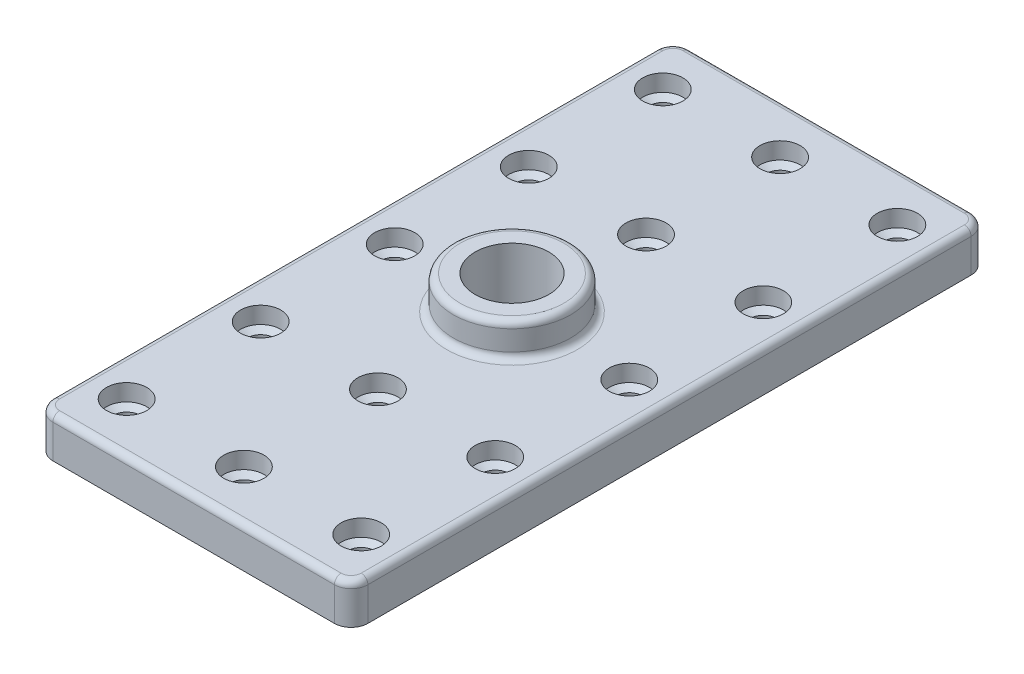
from build123d import *

# Parameters (mm, degrees)
SKETCH1_W            = 94
SKETCH1_H            = 190
PLATE_DEPTH          = 12
SKETCH2_R            = 17.5
BOSS_DEPTH           = 10
SKETCH3_R            = 11
CENTER_HOLE_DEPTH    = 109.249711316
FILLET_R5_R          = 5
FILLET_R2_R          = 2
LPATTERN2_COUNT      = 5
LPATTERN2_PITCH      = 40
LPATTERN2_COUNT_DIR2 = 3
LPATTERN2_PITCH_DIR2 = 35


with BuildPart() as part:
    # Sketch1 → plate (new body)
    with BuildSketch(Plane(origin=(0, 0, 0), x_dir=(1, 0, 0), z_dir=(0, 1, 0))):
        Rectangle(SKETCH1_W, SKETCH1_H)
    extrude(amount=PLATE_DEPTH)

    # Sketch2 → boss (add)
    with BuildSketch(Plane(origin=(0, 12, 0), x_dir=(-1, 0, 0), z_dir=(0, 1, 0))):
        with Locations(Location((0, 0, 0), (0, 0, 270))):
            Circle(SKETCH2_R)
    extrude(amount=BOSS_DEPTH)

    # Sketch3 → center hole (cut, through all)
    with BuildSketch(Plane(origin=(0, 22, 0), x_dir=(-1, 0, 0), z_dir=(0, 1, 0))):
        with Locations(Location((0, 0, 0), (0, 0, 90))):
            Circle(SKETCH3_R)
    extrude(amount=-CENTER_HOLE_DEPTH, mode=Mode.SUBTRACT)

    # Sketch4 → pattern hole (revolve, cut)
    with BuildSketch(Plane(origin=(-35, 12, 80), x_dir=(0, 0, 1), z_dir=(1, 0, 0))):
        Polygon((0, 0), (0, 12), (4, 12), (4, 6.201721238), (6, 5), (6, 0), align=None)
    pattern_hole = revolve(axis=Axis((-35, 18.130023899, 80), (0, -1, 0)), mode=Mode.SUBTRACT)

    # Fillet R5
    fillet_r5_edges = [part.edges().sort_by_distance(p)[0] for p in [
        (-47, 6, -95),
        (47, 6, -95),
        (47, 6, 95),
        (-47, 6, 95),
    ]]
    fillet(fillet_r5_edges, radius=FILLET_R5_R)

    # Fillet R2
    fillet_r2_edges = [part.edges().sort_by_distance(p)[0] for p in [
        (0, 12, 17.5),
        (0, 22, 17.5),
        (47, 12, 0),
        (0, 12, 95),
        (-47, 12, 0),
        (0, 12, -95),
        (45.535533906, 12, -93.535533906),
        (-45.535533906, 12, -93.535533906),
        (-45.535533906, 12, 93.535533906),
        (45.535533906, 12, 93.535533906),
    ]]
    fillet(fillet_r2_edges, radius=FILLET_R2_R)

    # LPattern2: pattern hole 5 × 3, 1 skipped
    with Locations(*[(j * LPATTERN2_PITCH_DIR2, 0, -i * LPATTERN2_PITCH) for i in range(LPATTERN2_COUNT) for j in range(LPATTERN2_COUNT_DIR2) if (i, j) not in ((0, 0), (2, 1))]):
        add(pattern_hole, mode=Mode.SUBTRACT)


solid = part.part
